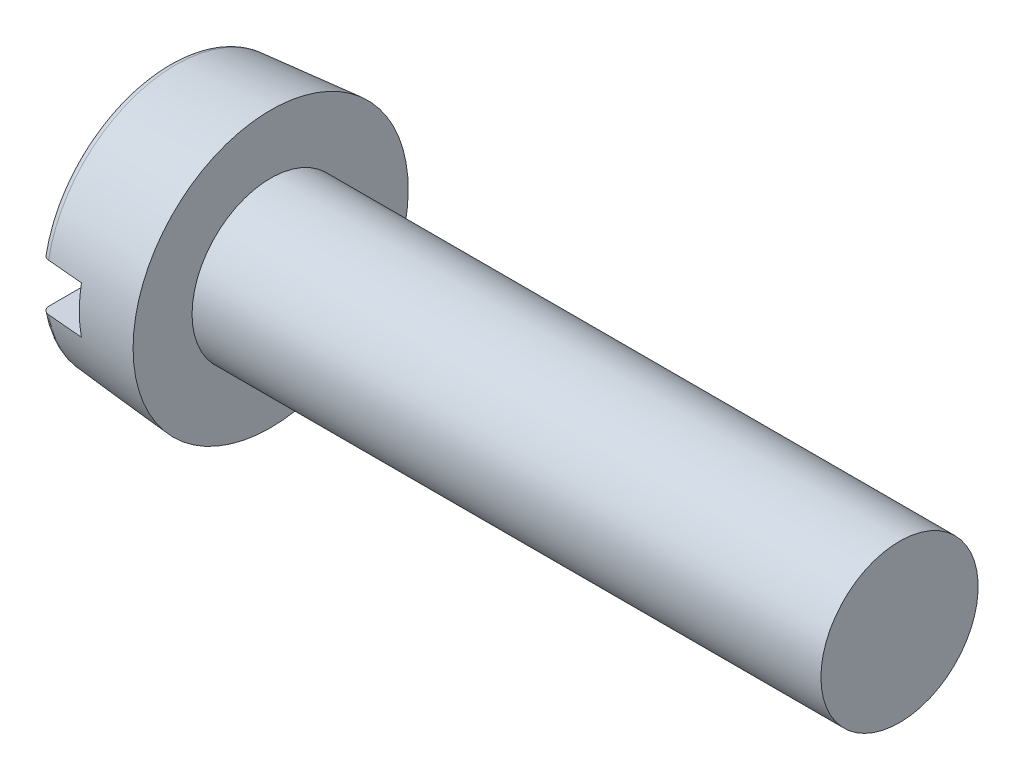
ISO-10303-21;
HEADER;
FILE_DESCRIPTION(('STEP AP214'),'2;1');
FILE_NAME('part.step','',(''),(''),'','','');
FILE_SCHEMA(('AUTOMOTIVE_DESIGN { 1 0 10303 214 1 1 1 1 }'));
ENDSEC;
DATA;
#1=APPLICATION_CONTEXT('core data for automotive mechanical design processes');
#2=APPLICATION_PROTOCOL_DEFINITION('international standard','automotive_design',2000,#1);
#3=PRODUCT_CONTEXT('',#1,'mechanical');
#4=PRODUCT('Part','Part','',(#3));
#5=PRODUCT_RELATED_PRODUCT_CATEGORY('part','',(#4));
#6=PRODUCT_DEFINITION_FORMATION('','',#4);
#7=PRODUCT_DEFINITION_CONTEXT('part definition',#1,'design');
#8=PRODUCT_DEFINITION('design','',#6,#7);
#9=PRODUCT_DEFINITION_SHAPE('','',#8);
#10=(LENGTH_UNIT() NAMED_UNIT(*) SI_UNIT(.MILLI.,.METRE.));
#11=(NAMED_UNIT(*) PLANE_ANGLE_UNIT() SI_UNIT($,.RADIAN.));
#12=(NAMED_UNIT(*) SI_UNIT($,.STERADIAN.) SOLID_ANGLE_UNIT());
#13=UNCERTAINTY_MEASURE_WITH_UNIT(LENGTH_MEASURE(1.E-05),#10,'distance_accuracy_value','');
#14=(GEOMETRIC_REPRESENTATION_CONTEXT(3) GLOBAL_UNCERTAINTY_ASSIGNED_CONTEXT((#13)) GLOBAL_UNIT_ASSIGNED_CONTEXT((#10,
#11,#12)) REPRESENTATION_CONTEXT('',''));
#15=CARTESIAN_POINT('',(0.,0.,0.));
#16=DIRECTION('',(0.,0.,1.));
#17=DIRECTION('',(1.,0.,0.));
#18=AXIS2_PLACEMENT_3D('',#15,#16,#17);
#19=CARTESIAN_POINT('',(0.,0.,0.));
#20=DIRECTION('',(-1.,0.,0.));
#21=DIRECTION('',(0.,0.,1.));
#22=AXIS2_PLACEMENT_3D('',#19,#20,#21);
#23=PLANE('',#22);
#24=DIRECTION('',(0.,0.,-1.));
#25=VECTOR('',#24,1.);
#26=CARTESIAN_POINT('',(0.,0.599999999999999,3.5));
#27=LINE('',#26,#25);
#28=CARTESIAN_POINT('',(0.,0.599999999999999,3.03043682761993));
#29=VERTEX_POINT('',#28);
#30=CARTESIAN_POINT('',(0.,0.599999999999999,-3.03043682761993));
#31=VERTEX_POINT('',#30);
#32=EDGE_CURVE('E103',#29,#31,#27,.T.);
#33=ORIENTED_EDGE('',*,*,#32,.F.);
#34=CARTESIAN_POINT('',(0.,0.,0.));
#35=DIRECTION('',(-1.,0.,0.));
#36=DIRECTION('',(0.,0.,1.));
#37=AXIS2_PLACEMENT_3D('',#34,#35,#36);
#38=CIRCLE('',#37,3.08926324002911);
#39=EDGE_CURVE('E106',#29,#31,#38,.T.);
#40=ORIENTED_EDGE('',*,*,#39,.T.);
#41=EDGE_LOOP('',(#33,#40));
#42=FACE_BOUND('',#41,.T.);
#43=ADVANCED_FACE('F35',(#42),#23,.T.);
#44=CARTESIAN_POINT('',(0.2,0.,0.));
#45=DIRECTION('',(-1.,0.,0.));
#46=DIRECTION('',(0.,0.,1.));
#47=AXIS2_PLACEMENT_3D('',#44,#45,#46);
#48=TOROIDAL_SURFACE('',#47,3.08926324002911,0.2);
#49=CARTESIAN_POINT('',(0.10595373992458,0.599999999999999,-3.21018161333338));
#50=CARTESIAN_POINT('',(0.115699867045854,0.599999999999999,-3.21546386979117));
#51=CARTESIAN_POINT('',(0.125895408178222,0.599999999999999,-3.21993251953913));
#52=CARTESIAN_POINT('',(0.146899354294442,0.599999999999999,-3.22710008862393));
#53=CARTESIAN_POINT('',(0.157708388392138,0.599999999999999,-3.22979715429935));
#54=CARTESIAN_POINT('',(0.179625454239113,0.599999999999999,-3.2333327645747));
#55=CARTESIAN_POINT('',(0.190733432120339,0.599999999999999,-3.23417164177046));
#56=CARTESIAN_POINT('',(0.212929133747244,0.599999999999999,-3.233964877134));
#57=CARTESIAN_POINT('',(0.224016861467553,0.599999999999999,-3.2329196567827));
#58=CARTESIAN_POINT('',(0.24582159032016,0.599999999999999,-3.22898503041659));
#59=CARTESIAN_POINT('',(0.256539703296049,0.599999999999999,-3.22610177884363));
#60=CARTESIAN_POINT('',(0.277343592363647,0.599999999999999,-3.21858540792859));
#61=CARTESIAN_POINT('',(0.287429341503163,0.599999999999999,-3.21395221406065));
#62=CARTESIAN_POINT('',(0.306739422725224,0.599999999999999,-3.20304847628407));
#63=CARTESIAN_POINT('',(0.315959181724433,0.599999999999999,-3.19676983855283));
#64=CARTESIAN_POINT('',(0.333231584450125,0.599999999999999,-3.18277301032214));
#65=CARTESIAN_POINT('',(0.341284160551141,0.599999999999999,-3.17505473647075));
#66=CARTESIAN_POINT('',(0.356112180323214,0.599999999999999,-3.15828860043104));
#67=CARTESIAN_POINT('',(0.362868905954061,0.599999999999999,-3.14922418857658));
#68=CARTESIAN_POINT('',(0.374794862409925,0.599999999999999,-3.13010544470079));
#69=CARTESIAN_POINT('',(0.379963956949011,0.599999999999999,-3.12005102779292));
#70=CARTESIAN_POINT('',(0.388661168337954,0.599999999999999,-3.09905295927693));
#71=CARTESIAN_POINT('',(0.392159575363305,0.599999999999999,-3.0880970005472));
#72=CARTESIAN_POINT('',(0.397296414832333,0.599999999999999,-3.06575733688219));
#73=CARTESIAN_POINT('',(0.398934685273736,0.599999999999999,-3.05437359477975));
#74=CARTESIAN_POINT('',(0.400323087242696,0.599999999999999,-3.03132781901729));
#75=CARTESIAN_POINT('',(0.40004590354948,0.599999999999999,-3.01966413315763));
#76=CARTESIAN_POINT('',(0.39754809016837,0.599999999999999,-2.9965463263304));
#77=CARTESIAN_POINT('',(0.39532736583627,0.599999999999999,-2.98509221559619));
#78=CARTESIAN_POINT('',(0.388983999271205,0.599999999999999,-2.96266069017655));
#79=CARTESIAN_POINT('',(0.384851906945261,0.599999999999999,-2.95168594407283));
#80=CARTESIAN_POINT('',(0.374790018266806,0.599999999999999,-2.93059330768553));
#81=CARTESIAN_POINT('',(0.368860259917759,0.599999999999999,-2.92047539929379));
#82=CARTESIAN_POINT('',(0.355413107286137,0.599999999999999,-2.90147355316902));
#83=CARTESIAN_POINT('',(0.347908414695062,0.599999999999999,-2.8925806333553));
#84=CARTESIAN_POINT('',(0.331487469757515,0.599999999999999,-2.87620998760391));
#85=CARTESIAN_POINT('',(0.322571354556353,0.599999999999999,-2.86873212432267));
#86=CARTESIAN_POINT('',(0.303753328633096,0.599999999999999,-2.85555292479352));
#87=CARTESIAN_POINT('',(0.293872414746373,0.599999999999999,-2.8498216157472));
#88=CARTESIAN_POINT('',(0.273273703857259,0.599999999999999,-2.84013920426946));
#89=CARTESIAN_POINT('',(0.262556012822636,0.599999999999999,-2.83618787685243));
#90=CARTESIAN_POINT('',(0.240822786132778,0.599999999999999,-2.83025814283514));
#91=CARTESIAN_POINT('',(0.229817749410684,0.599999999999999,-2.82824122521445));
#92=CARTESIAN_POINT('',(0.207625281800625,0.599999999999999,-2.82610837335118));
#93=CARTESIAN_POINT('',(0.196437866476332,0.599999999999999,-2.82599227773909));
#94=CARTESIAN_POINT('',(0.17433927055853,0.599999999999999,-2.82765455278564));
#95=CARTESIAN_POINT('',(0.163426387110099,0.599999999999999,-2.82941041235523));
#96=CARTESIAN_POINT('',(0.1420492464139,0.599999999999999,-2.83472469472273));
#97=CARTESIAN_POINT('',(0.131584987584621,0.599999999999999,-2.83828311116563));
#98=CARTESIAN_POINT('',(0.111366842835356,0.599999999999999,-2.8471025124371));
#99=CARTESIAN_POINT('',(0.101614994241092,0.599999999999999,-2.85236816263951));
#100=CARTESIAN_POINT('',(0.0831155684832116,0.599999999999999,-2.86443782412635));
#101=CARTESIAN_POINT('',(0.0743680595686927,0.599999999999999,-2.87124193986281));
#102=CARTESIAN_POINT('',(0.0579761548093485,0.599999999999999,-2.88630586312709));
#103=CARTESIAN_POINT('',(0.0503511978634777,0.599999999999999,-2.89458681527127));
#104=CARTESIAN_POINT('',(0.0365658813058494,0.599999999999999,-2.91228895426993));
#105=CARTESIAN_POINT('',(0.0304056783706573,0.599999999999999,-2.92171026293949));
#106=CARTESIAN_POINT('',(0.0195922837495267,0.599999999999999,-2.94163340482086));
#107=CARTESIAN_POINT('',(0.0149726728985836,0.599999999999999,-2.95215346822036));
#108=CARTESIAN_POINT('',(0.00753379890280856,0.599999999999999,-2.97381205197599));
#109=CARTESIAN_POINT('',(0.00471470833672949,0.599999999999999,-2.98495063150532));
#110=CARTESIAN_POINT('',(0.000917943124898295,0.599999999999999,-3.0077187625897));
#111=CARTESIAN_POINT('',(-2.99512472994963E-05,0.599999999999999,-3.01935328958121));
#112=CARTESIAN_POINT('',(3.13982112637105E-05,0.599999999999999,-3.04261715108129));
#113=CARTESIAN_POINT('',(0.00104065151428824,0.599999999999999,-3.05424648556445));
#114=CARTESIAN_POINT('',(0.00500199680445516,0.599999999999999,-3.077221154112));
#115=CARTESIAN_POINT('',(0.00796235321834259,0.599999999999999,-3.08856506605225));
#116=CARTESIAN_POINT('',(0.0157616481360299,0.599999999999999,-3.11059162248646));
#117=CARTESIAN_POINT('',(0.0206009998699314,0.599999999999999,-3.12127412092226));
#118=CARTESIAN_POINT('',(0.0319873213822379,0.599999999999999,-3.14158024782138));
#119=CARTESIAN_POINT('',(0.0385211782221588,0.599999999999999,-3.15121123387));
#120=CARTESIAN_POINT('',(0.0531333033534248,0.599999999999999,-3.16920723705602));
#121=CARTESIAN_POINT('',(0.0612095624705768,0.599999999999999,-3.17757387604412));
#122=CARTESIAN_POINT('',(0.0754611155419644,0.599999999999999,-3.18998949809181));
#123=CARTESIAN_POINT('',(0.0812448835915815,0.599999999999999,-3.1944955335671));
#124=CARTESIAN_POINT('',(0.0932716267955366,0.599999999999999,-3.20284662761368));
#125=CARTESIAN_POINT('',(0.0995145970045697,0.599999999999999,-3.2066916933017));
#126=CARTESIAN_POINT('',(0.10595373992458,0.599999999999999,-3.21018161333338));
#127=B_SPLINE_CURVE_WITH_KNOTS('',3,(#49,#50,#51,#52,#53,#54,#55,#56,#57,#58,#59,#60,#61,#62,
#63,#64,#65,#66,#67,#68,#69,#70,#71,#72,#73,#74,#75,#76,#77,#78,#79,#80,#81,#82,#83,#84,#85,#86,
#87,#88,#89,#90,#91,#92,#93,#94,#95,#96,#97,#98,#99,#100,#101,#102,#103,#104,#105,#106,#107,
#108,#109,#110,#111,#112,#113,#114,#115,#116,#117,#118,#119,#120,#121,#122,#123,#124,#125,#126),
.UNSPECIFIED.,.T.,.F.,(4,2,2,2,2,2,2,2,2,2,2,2,2,2,2,2,2,2,2,2,2,2,2,2,2,2,2,2,2,2,2,2,2,2,2,2,
2,2,4),(0.,0.0332301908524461,0.0664950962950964,0.099754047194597,0.133005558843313,
0.16614631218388,0.199288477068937,0.232596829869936,0.265907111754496,0.29966728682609,
0.333430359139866,0.367773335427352,0.402119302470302,0.436956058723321,0.471794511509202,
0.506807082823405,0.541818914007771,0.576558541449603,0.611294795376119,0.645396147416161,
0.679493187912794,0.712896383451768,0.746296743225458,0.779299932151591,0.812303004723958,
0.845397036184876,0.87849331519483,0.912108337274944,0.945726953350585,0.980036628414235,
1.01434959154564,1.04920438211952,1.08405934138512,1.11906289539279,1.15407415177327,
1.18882216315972,1.22352521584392,1.245480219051,1.26743498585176),.UNSPECIFIED.);
#128=CARTESIAN_POINT('',(0.182568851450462,0.599999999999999,-3.23330273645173));
#129=VERTEX_POINT('',#128);
#130=EDGE_CURVE('E58',#31,#129,#127,.T.);
#131=ORIENTED_EDGE('',*,*,#130,.F.);
#132=ORIENTED_EDGE('',*,*,#39,.F.);
#133=CARTESIAN_POINT('',(0.105016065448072,0.599999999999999,2.85080142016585));
#134=CARTESIAN_POINT('',(0.114691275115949,0.599999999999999,2.84546620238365));
#135=CARTESIAN_POINT('',(0.12481865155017,0.599999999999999,2.84093609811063));
#136=CARTESIAN_POINT('',(0.145696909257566,0.599999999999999,2.83363379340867));
#137=CARTESIAN_POINT('',(0.156448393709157,0.599999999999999,2.83086332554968));
#138=CARTESIAN_POINT('',(0.178265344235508,0.599999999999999,2.82717406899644));
#139=CARTESIAN_POINT('',(0.189330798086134,0.599999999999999,2.82625520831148));
#140=CARTESIAN_POINT('',(0.211455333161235,0.599999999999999,2.82629971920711));
#141=CARTESIAN_POINT('',(0.222514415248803,0.599999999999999,2.82726268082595));
#142=CARTESIAN_POINT('',(0.24425666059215,0.599999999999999,2.83102874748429));
#143=CARTESIAN_POINT('',(0.254941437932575,0.599999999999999,2.833822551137));
#144=CARTESIAN_POINT('',(0.27569543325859,0.599999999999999,2.84115235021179));
#145=CARTESIAN_POINT('',(0.285764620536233,0.599999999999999,2.84568843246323));
#146=CARTESIAN_POINT('',(0.305080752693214,0.599999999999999,2.85639977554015));
#147=CARTESIAN_POINT('',(0.314321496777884,0.599999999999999,2.86258620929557));
#148=CARTESIAN_POINT('',(0.331656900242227,0.599999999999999,2.87639692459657));
#149=CARTESIAN_POINT('',(0.339751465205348,0.599999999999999,2.88402132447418));
#150=CARTESIAN_POINT('',(0.354722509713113,0.599999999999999,2.90063675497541));
#151=CARTESIAN_POINT('',(0.361574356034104,0.599999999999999,2.90964997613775));
#152=CARTESIAN_POINT('',(0.373703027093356,0.599999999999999,2.92868002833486));
#153=CARTESIAN_POINT('',(0.378979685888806,0.599999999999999,2.93869696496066));
#154=CARTESIAN_POINT('',(0.387916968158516,0.599999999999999,2.95966673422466));
#155=CARTESIAN_POINT('',(0.391542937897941,0.599999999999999,2.97063434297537));
#156=CARTESIAN_POINT('',(0.396928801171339,0.599999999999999,2.99301875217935));
#157=CARTESIAN_POINT('',(0.398688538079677,0.599999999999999,3.00443559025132));
#158=CARTESIAN_POINT('',(0.40030679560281,0.599999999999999,3.02755271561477));
#159=CARTESIAN_POINT('',(0.400140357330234,0.599999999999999,3.03925475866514));
#160=CARTESIAN_POINT('',(0.397847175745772,0.599999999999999,3.06246562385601));
#161=CARTESIAN_POINT('',(0.395720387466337,0.599999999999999,3.07397444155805));
#162=CARTESIAN_POINT('',(0.389555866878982,0.599999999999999,3.09647750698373));
#163=CARTESIAN_POINT('',(0.385516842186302,0.599999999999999,3.1074714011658));
#164=CARTESIAN_POINT('',(0.375630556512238,0.599999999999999,3.12861423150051));
#165=CARTESIAN_POINT('',(0.369783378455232,0.599999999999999,3.13876320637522));
#166=CARTESIAN_POINT('',(0.356510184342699,0.599999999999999,3.15780612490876));
#167=CARTESIAN_POINT('',(0.349102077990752,0.599999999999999,3.1667125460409));
#168=CARTESIAN_POINT('',(0.332872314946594,0.599999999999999,3.18312834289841));
#169=CARTESIAN_POINT('',(0.324050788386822,0.599999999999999,3.19063784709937));
#170=CARTESIAN_POINT('',(0.305405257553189,0.599999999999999,3.20390997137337));
#171=CARTESIAN_POINT('',(0.295600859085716,0.599999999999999,3.20970013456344));
#172=CARTESIAN_POINT('',(0.275147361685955,0.599999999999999,3.21952148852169));
#173=CARTESIAN_POINT('',(0.264498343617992,0.599999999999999,3.22355284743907));
#174=CARTESIAN_POINT('',(0.242839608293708,0.599999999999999,3.22967901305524));
#175=CARTESIAN_POINT('',(0.231838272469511,0.599999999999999,3.23180347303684));
#176=CARTESIAN_POINT('',(0.209634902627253,0.599999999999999,3.2341574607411));
#177=CARTESIAN_POINT('',(0.198432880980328,0.599999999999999,3.23438710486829));
#178=CARTESIAN_POINT('',(0.176248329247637,0.599999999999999,3.23295068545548));
#179=CARTESIAN_POINT('',(0.165264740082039,0.599999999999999,3.23130090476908));
#180=CARTESIAN_POINT('',(0.143729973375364,0.599999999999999,3.22618337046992));
#181=CARTESIAN_POINT('',(0.133178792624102,0.599999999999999,3.22271563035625));
#182=CARTESIAN_POINT('',(0.112787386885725,0.599999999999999,3.21406153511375));
#183=CARTESIAN_POINT('',(0.102948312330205,0.599999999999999,3.20887247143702));
#184=CARTESIAN_POINT('',(0.0842683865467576,0.599999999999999,3.19693335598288));
#185=CARTESIAN_POINT('',(0.0754275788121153,0.599999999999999,3.19018323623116));
#186=CARTESIAN_POINT('',(0.0588875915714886,0.599999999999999,3.17523730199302));
#187=CARTESIAN_POINT('',(0.0512021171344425,0.599999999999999,3.16702632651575));
#188=CARTESIAN_POINT('',(0.0372916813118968,0.599999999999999,3.14944895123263));
#189=CARTESIAN_POINT('',(0.0310668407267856,0.599999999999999,3.14008245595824));
#190=CARTESIAN_POINT('',(0.0201439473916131,0.599999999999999,3.1202940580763));
#191=CARTESIAN_POINT('',(0.0154729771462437,0.599999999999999,3.10985720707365));
#192=CARTESIAN_POINT('',(0.00791811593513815,0.599999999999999,3.08835564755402));
#193=CARTESIAN_POINT('',(0.00503438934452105,0.599999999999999,3.07729088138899));
#194=CARTESIAN_POINT('',(0.00109145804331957,0.599999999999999,3.05465747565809));
#195=CARTESIAN_POINT('',(6.22854021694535E-05,0.599999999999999,3.04308359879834));
#196=CARTESIAN_POINT('',(-5.67976142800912E-05,0.599999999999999,3.01992599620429));
#197=CARTESIAN_POINT('',(0.000853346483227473,0.599999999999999,3.00834227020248));
#198=CARTESIAN_POINT('',(0.00460421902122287,0.599999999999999,2.98538851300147));
#199=CARTESIAN_POINT('',(0.00746152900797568,0.599999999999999,2.97402118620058));
#200=CARTESIAN_POINT('',(0.0150510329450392,0.599999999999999,2.95192660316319));
#201=CARTESIAN_POINT('',(0.0197836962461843,0.599999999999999,2.94119950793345));
#202=CARTESIAN_POINT('',(0.0309827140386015,0.599999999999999,2.92073316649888));
#203=CARTESIAN_POINT('',(0.0374439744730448,0.599999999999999,2.91099113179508));
#204=CARTESIAN_POINT('',(0.0519300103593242,0.599999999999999,2.89276112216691));
#205=CARTESIAN_POINT('',(0.0599527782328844,0.599999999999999,2.88427156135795));
#206=CARTESIAN_POINT('',(0.074201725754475,0.599999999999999,2.87159228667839));
#207=CARTESIAN_POINT('',(0.0800356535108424,0.599999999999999,2.86695454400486));
#208=CARTESIAN_POINT('',(0.0921833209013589,0.599999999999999,2.85835650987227));
#209=CARTESIAN_POINT('',(0.0984970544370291,0.599999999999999,2.85439620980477));
#210=CARTESIAN_POINT('',(0.105016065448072,0.599999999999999,2.85080142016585));
#211=B_SPLINE_CURVE_WITH_KNOTS('',3,(#133,#134,#135,#136,#137,#138,#139,#140,#141,#142,#143,
#144,#145,#146,#147,#148,#149,#150,#151,#152,#153,#154,#155,#156,#157,#158,#159,#160,#161,#162,
#163,#164,#165,#166,#167,#168,#169,#170,#171,#172,#173,#174,#175,#176,#177,#178,#179,#180,#181,
#182,#183,#184,#185,#186,#187,#188,#189,#190,#191,#192,#193,#194,#195,#196,#197,#198,#199,#200,
#201,#202,#203,#204,#205,#206,#207,#208,#209,#210),.UNSPECIFIED.,.T.,.F.,(4,2,2,2,2,2,2,2,2,2,2,
2,2,2,2,2,2,2,2,2,2,2,2,2,2,2,2,2,2,2,2,2,2,2,2,2,2,2,4),(0.,0.0331194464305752,
0.0662714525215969,0.0994221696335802,0.132565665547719,0.165542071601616,0.198520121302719,
0.23172736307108,0.264937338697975,0.298746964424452,0.332560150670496,0.367053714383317,
0.401550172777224,0.436494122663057,0.471438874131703,0.506407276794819,0.541374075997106,
0.575959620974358,0.610541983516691,0.644536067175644,0.678526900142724,0.711979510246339,
0.745430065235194,0.778593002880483,0.811755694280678,0.844970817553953,0.878187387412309,
0.91177126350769,0.945357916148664,0.979502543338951,1.01365031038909,1.04834624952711,
1.08304316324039,1.11803930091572,1.15304420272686,1.18794706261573,1.22280534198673,
1.24512101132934,1.26743639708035),.UNSPECIFIED.);
#212=CARTESIAN_POINT('',(0.182568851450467,0.599999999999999,3.23330273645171));
#213=VERTEX_POINT('',#212);
#214=EDGE_CURVE('E95',#213,#29,#211,.T.);
#215=ORIENTED_EDGE('',*,*,#214,.F.);
#216=CARTESIAN_POINT('',(0.182568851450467,0.,0.));
#217=DIRECTION('',(-1.,0.,0.));
#218=DIRECTION('',(0.,0.,1.));
#219=AXIS2_PLACEMENT_3D('',#216,#217,#218);
#220=CIRCLE('',#219,3.28850217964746);
#221=EDGE_CURVE('E110',#129,#213,#220,.F.);
#222=ORIENTED_EDGE('',*,*,#221,.F.);
#223=EDGE_LOOP('',(#131,#132,#215,#222));
#224=FACE_BOUND('',#223,.T.);
#225=ADVANCED_FACE('F181',(#224),#48,.T.);
#226=CARTESIAN_POINT('',(-25.4,0.,0.));
#227=DIRECTION('',(-1.,0.,0.));
#228=DIRECTION('',(0.,0.,1.));
#229=AXIS2_PLACEMENT_3D('',#226,#227,#228);
#230=CYLINDRICAL_SURFACE('',#229,2.);
#231=CARTESIAN_POINT('',(18.6,0.,0.));
#232=DIRECTION('',(-1.,0.,0.));
#233=DIRECTION('',(0.,0.,1.));
#234=AXIS2_PLACEMENT_3D('',#231,#232,#233);
#235=CIRCLE('',#234,2.);
#236=CARTESIAN_POINT('',(18.6,0.,2.));
#237=VERTEX_POINT('',#236);
#238=EDGE_CURVE('E170',#237,#237,#235,.T.);
#239=ORIENTED_EDGE('',*,*,#238,.T.);
#240=EDGE_LOOP('',(#239));
#241=FACE_BOUND('',#240,.T.);
#242=CARTESIAN_POINT('',(2.6,0.,0.));
#243=DIRECTION('',(-1.,0.,0.));
#244=DIRECTION('',(0.,0.,1.));
#245=AXIS2_PLACEMENT_3D('',#242,#243,#244);
#246=CIRCLE('',#245,2.);
#247=CARTESIAN_POINT('',(2.6,0.,2.));
#248=VERTEX_POINT('',#247);
#249=EDGE_CURVE('E107',#248,#248,#246,.T.);
#250=ORIENTED_EDGE('',*,*,#249,.F.);
#251=EDGE_LOOP('',(#250));
#252=FACE_BOUND('',#251,.T.);
#253=ADVANCED_FACE('F37',(#241,#252),#230,.T.);
#254=CARTESIAN_POINT('',(2.6,2.,0.));
#255=DIRECTION('',(-1.,0.,0.));
#256=DIRECTION('',(0.,0.,1.));
#257=AXIS2_PLACEMENT_3D('',#254,#255,#256);
#258=PLANE('',#257);
#259=CARTESIAN_POINT('',(2.6,0.,0.));
#260=DIRECTION('',(-1.,0.,0.));
#261=DIRECTION('',(0.,0.,1.));
#262=AXIS2_PLACEMENT_3D('',#259,#260,#261);
#263=CIRCLE('',#262,3.5);
#264=CARTESIAN_POINT('',(2.6,0.,3.5));
#265=VERTEX_POINT('',#264);
#266=EDGE_CURVE('E112',#265,#265,#263,.T.);
#267=ORIENTED_EDGE('',*,*,#266,.F.);
#268=EDGE_LOOP('',(#267));
#269=FACE_BOUND('',#268,.T.);
#270=ORIENTED_EDGE('',*,*,#249,.T.);
#271=EDGE_LOOP('',(#270));
#272=FACE_BOUND('',#271,.T.);
#273=ADVANCED_FACE('F155',(#269,#272),#258,.F.);
#274=CARTESIAN_POINT('',(0.,0.,0.));
#275=DIRECTION('',(1.,0.,0.));
#276=DIRECTION('',(0.,0.,-1.));
#277=AXIS2_PLACEMENT_3D('',#274,#275,#276);
#278=CONICAL_SURFACE('',#277,3.2725294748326,0.0872664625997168);
#279=CARTESIAN_POINT('',(-5.50655611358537,0.599999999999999,-2.72550680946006));
#280=CARTESIAN_POINT('',(-3.80202221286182,0.599999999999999,-2.87818079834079));
#281=CARTESIAN_POINT('',(-2.0974409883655,0.599999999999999,-3.03032472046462));
#282=CARTESIAN_POINT('',(-0.067381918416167,0.599999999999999,-3.2110638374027));
#283=CARTESIAN_POINT('',(0.258063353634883,0.599999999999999,-3.24002475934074));
#284=CARTESIAN_POINT('',(2.61358356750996,0.599999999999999,-3.44954593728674));
#285=CARTESIAN_POINT('',(4.64370165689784,0.599999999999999,-3.62962140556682));
#286=CARTESIAN_POINT('',(6.67384119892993,0.599999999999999,-3.80945351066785));
#287=B_SPLINE_CURVE_WITH_KNOTS('',3,(#279,#280,#281,#282,#283,#284,#285,#286),.UNSPECIFIED.,.F.,
.F.,(4,2,2,4),(0.,5.13407279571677,6.11426677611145,12.2285333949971),.UNSPECIFIED.);
#288=CARTESIAN_POINT('',(1.1,0.599999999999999,-3.31490439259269));
#289=VERTEX_POINT('',#288);
#290=EDGE_CURVE('E165',#129,#289,#287,.T.);
#291=ORIENTED_EDGE('',*,*,#290,.F.);
#292=ORIENTED_EDGE('',*,*,#221,.T.);
#293=CARTESIAN_POINT('',(6.67384119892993,0.599999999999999,3.80945351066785));
#294=CARTESIAN_POINT('',(5.65877031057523,0.599999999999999,3.7195495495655));
#295=CARTESIAN_POINT('',(4.64370583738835,0.599999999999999,3.62957307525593));
#296=CARTESIAN_POINT('',(2.6135939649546,0.599999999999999,3.44942842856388));
#297=CARTESIAN_POINT('',(1.59854656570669,0.599999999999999,3.359260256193));
#298=CARTESIAN_POINT('',(-0.431527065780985,0.599999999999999,3.17868552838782));
#299=CARTESIAN_POINT('',(-1.44655329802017,0.599999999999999,3.088278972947));
#300=CARTESIAN_POINT('',(-3.47657760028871,0.599999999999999,2.90714957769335));
#301=CARTESIAN_POINT('',(-4.49157567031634,0.599999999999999,2.81642673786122));
#302=CARTESIAN_POINT('',(-5.50655611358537,0.599999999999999,2.72550680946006));
#303=B_SPLINE_CURVE_WITH_KNOTS('',3,(#293,#294,#295,#296,#297,#298,#299,#300,#301,#302),
.UNSPECIFIED.,.F.,.F.,(4,2,2,2,4),(0.,3.05713341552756,6.11426664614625,9.17139996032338,
12.2285334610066),.UNSPECIFIED.);
#304=CARTESIAN_POINT('',(1.1,0.599999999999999,3.31490439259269));
#305=VERTEX_POINT('',#304);
#306=EDGE_CURVE('E161',#305,#213,#303,.T.);
#307=ORIENTED_EDGE('',*,*,#306,.F.);
#308=CARTESIAN_POINT('',(1.1,0.,0.));
#309=DIRECTION('',(-1.,0.,0.));
#310=DIRECTION('',(0.,0.,1.));
#311=AXIS2_PLACEMENT_3D('',#308,#309,#310);
#312=CIRCLE('',#311,3.36876700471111);
#313=CARTESIAN_POINT('',(1.1,-0.6,3.31490439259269));
#314=VERTEX_POINT('',#313);
#315=EDGE_CURVE('E39',#305,#314,#312,.F.);
#316=ORIENTED_EDGE('',*,*,#315,.T.);
#317=CARTESIAN_POINT('',(-5.50655611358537,-0.6,2.72550680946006));
#318=CARTESIAN_POINT('',(-3.80202221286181,-0.6,2.87818079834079));
#319=CARTESIAN_POINT('',(-2.0974409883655,-0.6,3.03032472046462));
#320=CARTESIAN_POINT('',(-0.0673819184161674,-0.6,3.2110638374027));
#321=CARTESIAN_POINT('',(0.258063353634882,-0.6,3.24002475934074));
#322=CARTESIAN_POINT('',(2.61358356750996,-0.6,3.44954593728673));
#323=CARTESIAN_POINT('',(4.64370165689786,-0.6,3.62962140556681));
#324=CARTESIAN_POINT('',(6.67384119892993,-0.6,3.80945351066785));
#325=B_SPLINE_CURVE_WITH_KNOTS('',3,(#317,#318,#319,#320,#321,#322,#323,#324),.UNSPECIFIED.,.F.,
.F.,(4,2,2,4),(0.,5.13407279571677,6.11426677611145,12.2285333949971),.UNSPECIFIED.);
#326=CARTESIAN_POINT('',(0.182568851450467,-0.6,3.23330273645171));
#327=VERTEX_POINT('',#326);
#328=EDGE_CURVE('E139',#327,#314,#325,.T.);
#329=ORIENTED_EDGE('',*,*,#328,.F.);
#330=CARTESIAN_POINT('',(0.182568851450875,-0.599999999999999,-3.23330273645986));
#331=VERTEX_POINT('',#330);
#332=EDGE_CURVE('E116',#327,#331,#220,.F.);
#333=ORIENTED_EDGE('',*,*,#332,.T.);
#334=CARTESIAN_POINT('',(6.67384119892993,-0.599999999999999,-3.80945351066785));
#335=CARTESIAN_POINT('',(5.65877031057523,-0.599999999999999,-3.7195495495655));
#336=CARTESIAN_POINT('',(4.64370583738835,-0.599999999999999,-3.62957307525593));
#337=CARTESIAN_POINT('',(2.6135939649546,-0.599999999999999,-3.44942842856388));
#338=CARTESIAN_POINT('',(1.59854656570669,-0.599999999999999,-3.359260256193));
#339=CARTESIAN_POINT('',(-0.431527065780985,-0.599999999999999,-3.17868552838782));
#340=CARTESIAN_POINT('',(-1.44655329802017,-0.6,-3.088278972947));
#341=CARTESIAN_POINT('',(-3.47657760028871,-0.6,-2.90714957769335));
#342=CARTESIAN_POINT('',(-4.49157567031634,-0.6,-2.81642673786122));
#343=CARTESIAN_POINT('',(-5.50655611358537,-0.6,-2.72550680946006));
#344=B_SPLINE_CURVE_WITH_KNOTS('',3,(#334,#335,#336,#337,#338,#339,#340,#341,#342,#343),
.UNSPECIFIED.,.F.,.F.,(4,2,2,2,4),(0.,3.05713341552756,6.11426664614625,9.17139996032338,
12.2285334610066),.UNSPECIFIED.);
#345=CARTESIAN_POINT('',(1.1,-0.599999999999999,-3.31490439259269));
#346=VERTEX_POINT('',#345);
#347=EDGE_CURVE('E90',#346,#331,#344,.T.);
#348=ORIENTED_EDGE('',*,*,#347,.F.);
#349=EDGE_CURVE('E11',#346,#289,#312,.F.);
#350=ORIENTED_EDGE('',*,*,#349,.T.);
#351=EDGE_LOOP('',(#291,#292,#307,#316,#329,#333,#348,#350));
#352=FACE_BOUND('',#351,.T.);
#353=ORIENTED_EDGE('',*,*,#266,.T.);
#354=EDGE_LOOP('',(#353));
#355=FACE_BOUND('',#354,.T.);
#356=ADVANCED_FACE('F151',(#352,#355),#278,.T.);
#357=DIRECTION('',(0.,0.,1.));
#358=VECTOR('',#357,1.);
#359=CARTESIAN_POINT('',(0.,-0.599999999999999,-3.5));
#360=LINE('',#359,#358);
#361=CARTESIAN_POINT('',(0.,-0.599999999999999,-3.03043682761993));
#362=VERTEX_POINT('',#361);
#363=CARTESIAN_POINT('',(0.,-0.6,3.03043682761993));
#364=VERTEX_POINT('',#363);
#365=EDGE_CURVE('E50',#362,#364,#360,.T.);
#366=ORIENTED_EDGE('',*,*,#365,.F.);
#367=EDGE_CURVE('E101',#362,#364,#38,.T.);
#368=ORIENTED_EDGE('',*,*,#367,.T.);
#369=EDGE_LOOP('',(#366,#368));
#370=FACE_BOUND('',#369,.T.);
#371=ADVANCED_FACE('F100',(#370),#23,.T.);
#372=CARTESIAN_POINT('',(18.6,2.,0.));
#373=DIRECTION('',(1.,0.,0.));
#374=DIRECTION('',(0.,0.,-1.));
#375=AXIS2_PLACEMENT_3D('',#372,#373,#374);
#376=PLANE('',#375);
#377=ORIENTED_EDGE('',*,*,#238,.F.);
#378=EDGE_LOOP('',(#377));
#379=FACE_BOUND('',#378,.T.);
#380=ADVANCED_FACE('F193',(#379),#376,.T.);
#381=CARTESIAN_POINT('',(0.10595373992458,-0.599999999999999,-3.21018161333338));
#382=CARTESIAN_POINT('',(0.0960146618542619,-0.599999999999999,-3.20479360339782));
#383=CARTESIAN_POINT('',(0.0865284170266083,-0.599999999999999,-3.19855129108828));
#384=CARTESIAN_POINT('',(0.0687367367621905,-0.599999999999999,-3.18455028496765));
#385=CARTESIAN_POINT('',(0.0604329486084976,-0.599999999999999,-3.17678951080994));
#386=CARTESIAN_POINT('',(0.0452497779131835,-0.599999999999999,-3.15999804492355));
#387=CARTESIAN_POINT('',(0.0383686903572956,-0.599999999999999,-3.15096889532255));
#388=CARTESIAN_POINT('',(0.0261997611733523,-0.599999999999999,-3.13189878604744));
#389=CARTESIAN_POINT('',(0.0209115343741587,-0.599999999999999,-3.12185807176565));
#390=CARTESIAN_POINT('',(0.0120001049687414,-0.599999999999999,-3.10091081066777));
#391=CARTESIAN_POINT('',(0.00839912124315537,-0.599999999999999,-3.08999481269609));
#392=CARTESIAN_POINT('',(0.00305136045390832,-0.599999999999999,-3.06771714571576));
#393=CARTESIAN_POINT('',(0.00130482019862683,-0.599999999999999,-3.0563554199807));
#394=CARTESIAN_POINT('',(-0.000304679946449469,-0.599999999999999,-3.03333344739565));
#395=CARTESIAN_POINT('',(-0.000139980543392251,-0.599999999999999,-3.02167126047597));
#396=CARTESIAN_POINT('',(0.00213350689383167,-0.599999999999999,-2.99853754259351));
#397=CARTESIAN_POINT('',(0.00424239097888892,-0.6,-2.9870660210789));
#398=CARTESIAN_POINT('',(0.0103660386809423,-0.6,-2.96457689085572));
#399=CARTESIAN_POINT('',(0.0143909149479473,-0.6,-2.95356203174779));
#400=CARTESIAN_POINT('',(0.0242460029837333,-0.6,-2.93237123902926));
#401=CARTESIAN_POINT('',(0.0300761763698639,-0.6,-2.92219528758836));
#402=CARTESIAN_POINT('',(0.0433378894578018,-0.6,-2.90305748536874));
#403=CARTESIAN_POINT('',(0.0507572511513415,-0.6,-2.89408720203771));
#404=CARTESIAN_POINT('',(0.0670217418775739,-0.6,-2.87754799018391));
#405=CARTESIAN_POINT('',(0.0758667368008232,-0.6,-2.86997892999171));
#406=CARTESIAN_POINT('',(0.0945622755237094,-0.6,-2.85660637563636));
#407=CARTESIAN_POINT('',(0.104391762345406,-0.6,-2.85077345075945));
#408=CARTESIAN_POINT('',(0.124905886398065,-0.6,-2.8408806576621));
#409=CARTESIAN_POINT('',(0.135590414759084,-0.6,-2.8368205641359));
#410=CARTESIAN_POINT('',(0.157276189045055,-0.6,-2.83067225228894));
#411=CARTESIAN_POINT('',(0.168266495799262,-0.6,-2.82854542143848));
#412=CARTESIAN_POINT('',(0.190448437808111,-0.6,-2.82619258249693));
#413=CARTESIAN_POINT('',(0.2016400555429,-0.6,-2.82596640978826));
#414=CARTESIAN_POINT('',(0.223761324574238,-0.6,-2.82741304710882));
#415=CARTESIAN_POINT('',(0.234692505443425,-0.6,-2.82906261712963));
#416=CARTESIAN_POINT('',(0.256123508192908,-0.6,-2.83416971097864));
#417=CARTESIAN_POINT('',(0.266623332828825,-0.6,-2.83762722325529));
#418=CARTESIAN_POINT('',(0.286924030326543,-0.6,-2.84625101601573));
#419=CARTESIAN_POINT('',(0.296723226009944,-0.6,-2.85142124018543));
#420=CARTESIAN_POINT('',(0.315332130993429,-0.6,-2.86330962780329));
#421=CARTESIAN_POINT('',(0.324141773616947,-0.6,-2.87002789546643));
#422=CARTESIAN_POINT('',(0.340669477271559,-0.6,-2.88492851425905));
#423=CARTESIAN_POINT('',(0.348368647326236,-0.6,-2.89313181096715));
#424=CARTESIAN_POINT('',(0.362314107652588,-0.6,-2.91069187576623));
#425=CARTESIAN_POINT('',(0.368560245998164,-0.6,-2.92004876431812));
#426=CARTESIAN_POINT('',(0.379556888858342,-0.6,-2.93985667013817));
#427=CARTESIAN_POINT('',(0.384274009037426,-0.6,-2.95032622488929));
#428=CARTESIAN_POINT('',(0.391915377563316,-0.6,-2.97190043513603));
#429=CARTESIAN_POINT('',(0.394839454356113,-0.6,-2.98300515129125));
#430=CARTESIAN_POINT('',(0.398853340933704,-0.6,-3.00572547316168));
#431=CARTESIAN_POINT('',(0.399913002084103,-0.599999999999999,-3.01734641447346));
#432=CARTESIAN_POINT('',(0.400076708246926,-0.599999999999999,-3.040602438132));
#433=CARTESIAN_POINT('',(0.399180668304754,-0.599999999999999,-3.05223752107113));
#434=CARTESIAN_POINT('',(0.395443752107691,-0.599999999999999,-3.07524842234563));
#435=CARTESIAN_POINT('',(0.392593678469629,-0.599999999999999,-3.08662275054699));
#436=CARTESIAN_POINT('',(0.385009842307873,-0.599999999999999,-3.10872565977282));
#437=CARTESIAN_POINT('',(0.380276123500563,-0.599999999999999,-3.11945425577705));
#438=CARTESIAN_POINT('',(0.369091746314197,-0.599999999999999,-3.13986909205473));
#439=CARTESIAN_POINT('',(0.362654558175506,-0.599999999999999,-3.1495627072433));
#440=CARTESIAN_POINT('',(0.348219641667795,-0.599999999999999,-3.16770913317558));
#441=CARTESIAN_POINT('',(0.340222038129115,-0.599999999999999,-3.17616204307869));
#442=CARTESIAN_POINT('',(0.323027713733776,-0.599999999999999,-3.19144232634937));
#443=CARTESIAN_POINT('',(0.313851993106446,-0.599999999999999,-3.19829332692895));
#444=CARTESIAN_POINT('',(0.294464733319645,-0.599999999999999,-3.21032583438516));
#445=CARTESIAN_POINT('',(0.284253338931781,-0.599999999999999,-3.2155075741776));
#446=CARTESIAN_POINT('',(0.263272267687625,-0.599999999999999,-3.22396402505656));
#447=CARTESIAN_POINT('',(0.252515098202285,-0.599999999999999,-3.22726978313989));
#448=CARTESIAN_POINT('',(0.230592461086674,-0.599999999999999,-3.23200581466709));
#449=CARTESIAN_POINT('',(0.219426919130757,-0.599999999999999,-3.23343574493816));
#450=CARTESIAN_POINT('',(0.197138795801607,-0.599999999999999,-3.23436881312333));
#451=CARTESIAN_POINT('',(0.186017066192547,-0.599999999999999,-3.23389272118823));
#452=CARTESIAN_POINT('',(0.164022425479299,-0.599999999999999,-3.23107504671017));
#453=CARTESIAN_POINT('',(0.153149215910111,-0.599999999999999,-3.22873583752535));
#454=CARTESIAN_POINT('',(0.136218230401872,-0.599999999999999,-3.2235728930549));
#455=CARTESIAN_POINT('',(0.129980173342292,-0.599999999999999,-3.22132097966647));
#456=CARTESIAN_POINT('',(0.117760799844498,-0.599999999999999,-3.21620441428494));
#457=CARTESIAN_POINT('',(0.11177948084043,-0.599999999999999,-3.21333976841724));
#458=CARTESIAN_POINT('',(0.10595373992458,-0.599999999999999,-3.21018161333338));
#459=B_SPLINE_CURVE_WITH_KNOTS('',3,(#381,#382,#383,#384,#385,#386,#387,#388,#389,#390,#391,
#392,#393,#394,#395,#396,#397,#398,#399,#400,#401,#402,#403,#404,#405,#406,#407,#408,#409,#410,
#411,#412,#413,#414,#415,#416,#417,#418,#419,#420,#421,#422,#423,#424,#425,#426,#427,#428,#429,
#430,#431,#432,#433,#434,#435,#436,#437,#438,#439,#440,#441,#442,#443,#444,#445,#446,#447,#448,
#449,#450,#451,#452,#453,#454,#455,#456,#457,#458),.UNSPECIFIED.,.T.,.F.,(4,2,2,2,2,2,2,2,2,2,2,
2,2,2,2,2,2,2,2,2,2,2,2,2,2,2,2,2,2,2,2,2,2,2,2,2,2,2,4),(0.,0.0338920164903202,
0.0678307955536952,0.10172866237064,0.135618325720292,0.169942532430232,0.204271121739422,
0.239097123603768,0.273924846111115,0.308938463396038,0.343951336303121,0.378704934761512,
0.413455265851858,0.447577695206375,0.481695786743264,0.51511643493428,0.548534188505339,
0.58154237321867,0.61455034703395,0.647634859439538,0.680721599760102,0.714317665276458,
0.74791724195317,0.782207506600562,0.816501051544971,0.851344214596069,0.886188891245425,
0.921198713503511,0.956207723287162,0.990947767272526,1.02568503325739,1.05987207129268,
1.09405433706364,1.12765303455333,1.16125787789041,1.19449752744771,1.22769490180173,
1.24756073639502,1.26742637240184),.UNSPECIFIED.);
#460=EDGE_CURVE('E86',#331,#362,#459,.T.);
#461=ORIENTED_EDGE('',*,*,#460,.F.);
#462=ORIENTED_EDGE('',*,*,#332,.F.);
#463=CARTESIAN_POINT('',(0.105016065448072,-0.6,2.85080142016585));
#464=CARTESIAN_POINT('',(0.0950844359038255,-0.6,2.85627921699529));
#465=CARTESIAN_POINT('',(0.0856147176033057,-0.6,2.86261371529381));
#466=CARTESIAN_POINT('',(0.0678721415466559,-0.6,2.87679618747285));
#467=CARTESIAN_POINT('',(0.059601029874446,-0.6,2.88464633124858));
#468=CARTESIAN_POINT('',(0.0444968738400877,-0.6,2.90160680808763));
#469=CARTESIAN_POINT('',(0.0376618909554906,-0.6,2.91071541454));
#470=CARTESIAN_POINT('',(0.02559371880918,-0.6,2.92993348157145));
#471=CARTESIAN_POINT('',(0.0203601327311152,-0.6,2.94004269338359));
#472=CARTESIAN_POINT('',(0.0115562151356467,-0.6,2.96113928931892));
#473=CARTESIAN_POINT('',(0.00801194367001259,-0.6,2.97213755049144));
#474=CARTESIAN_POINT('',(0.00279364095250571,-0.6,2.99456990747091));
#475=CARTESIAN_POINT('',(0.00111984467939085,-0.6,3.00600405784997));
#476=CARTESIAN_POINT('',(-0.00032284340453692,-0.6,3.0291390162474));
#477=CARTESIAN_POINT('',(-6.71585840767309E-05,-0.6,3.04084136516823));
#478=CARTESIAN_POINT('',(0.00240390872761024,-0.6,3.06403774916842));
#479=CARTESIAN_POINT('',(0.00461933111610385,-0.6,3.07553178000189));
#480=CARTESIAN_POINT('',(0.0109573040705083,-0.6,3.09798695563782));
#481=CARTESIAN_POINT('',(0.0150805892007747,-0.6,3.10894789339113));
#482=CARTESIAN_POINT('',(0.0251289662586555,-0.6,3.13001071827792));
#483=CARTESIAN_POINT('',(0.0310539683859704,-0.6,3.14011264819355));
#484=CARTESIAN_POINT('',(0.0444717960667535,-0.6,3.15904704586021));
#485=CARTESIAN_POINT('',(0.0519464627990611,-0.6,3.1678923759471));
#486=CARTESIAN_POINT('',(0.0682980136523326,-0.6,3.18417542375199));
#487=CARTESIAN_POINT('',(0.0771747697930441,-0.6,3.19161326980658));
#488=CARTESIAN_POINT('',(0.095916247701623,-0.6,3.20473451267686));
#489=CARTESIAN_POINT('',(0.105761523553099,-0.6,3.21044568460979));
#490=CARTESIAN_POINT('',(0.126282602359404,-0.6,3.22010343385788));
#491=CARTESIAN_POINT('',(0.136958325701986,-0.6,3.22405018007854));
#492=CARTESIAN_POINT('',(0.158656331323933,-0.6,3.23000588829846));
#493=CARTESIAN_POINT('',(0.169670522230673,-0.6,3.23204435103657));
#494=CARTESIAN_POINT('',(0.191884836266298,-0.6,3.2342258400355));
#495=CARTESIAN_POINT('',(0.203084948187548,-0.6,3.23436898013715));
#496=CARTESIAN_POINT('',(0.225253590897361,-0.6,3.23276234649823));
#497=CARTESIAN_POINT('',(0.23622327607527,-0.6,3.23102843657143));
#498=CARTESIAN_POINT('',(0.257716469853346,-0.6,3.22574661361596));
#499=CARTESIAN_POINT('',(0.268239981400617,-0.6,3.22219871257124));
#500=CARTESIAN_POINT('',(0.288565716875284,-0.6,3.21338945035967));
#501=CARTESIAN_POINT('',(0.298366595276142,-0.6,3.20812498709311));
#502=CARTESIAN_POINT('',(0.31695837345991,-0.6,3.19604273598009));
#503=CARTESIAN_POINT('',(0.325749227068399,-0.6,3.18922487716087));
#504=CARTESIAN_POINT('',(0.34218002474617,-0.6,3.17415085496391));
#505=CARTESIAN_POINT('',(0.349805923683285,-0.6,3.16587938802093));
#506=CARTESIAN_POINT('',(0.363588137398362,-0.6,3.14819177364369));
#507=CARTESIAN_POINT('',(0.369744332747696,-0.6,3.1387755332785));
#508=CARTESIAN_POINT('',(0.380521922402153,-0.6,3.11889822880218));
#509=CARTESIAN_POINT('',(0.385116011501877,-0.6,3.10842236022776));
#510=CARTESIAN_POINT('',(0.392511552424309,-0.6,3.08685595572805));
#511=CARTESIAN_POINT('',(0.395312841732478,-0.6,3.07576536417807));
#512=CARTESIAN_POINT('',(0.39908584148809,-0.6,3.05309509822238));
#513=CARTESIAN_POINT('',(0.400027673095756,-0.6,3.04151044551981));
#514=CARTESIAN_POINT('',(0.39997108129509,-0.6,3.01834558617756));
#515=CARTESIAN_POINT('',(0.398972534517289,-0.6,3.00676537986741));
#516=CARTESIAN_POINT('',(0.395045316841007,-0.6,2.98383505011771));
#517=CARTESIAN_POINT('',(0.392100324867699,-0.6,2.97248771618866));
#518=CARTESIAN_POINT('',(0.384340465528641,-0.6,2.9504508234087));
#519=CARTESIAN_POINT('',(0.379525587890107,-0.6,2.93976126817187));
#520=CARTESIAN_POINT('',(0.36817282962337,-0.6,2.91939094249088));
#521=CARTESIAN_POINT('',(0.361641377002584,-0.6,2.90970659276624));
#522=CARTESIAN_POINT('',(0.347021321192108,-0.6,2.89159401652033));
#523=CARTESIAN_POINT('',(0.338932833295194,-0.6,2.88316569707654));
#524=CARTESIAN_POINT('',(0.321559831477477,-0.6,2.86794978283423));
#525=CARTESIAN_POINT('',(0.312295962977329,-0.6,2.86113862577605));
#526=CARTESIAN_POINT('',(0.292736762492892,-0.6,2.84920768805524));
#527=CARTESIAN_POINT('',(0.282441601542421,-0.6,2.84408762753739));
#528=CARTESIAN_POINT('',(0.261343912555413,-0.6,2.83579582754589));
#529=CARTESIAN_POINT('',(0.250556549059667,-0.6,2.83258548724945));
#530=CARTESIAN_POINT('',(0.228589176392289,-0.6,2.82805287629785));
#531=CARTESIAN_POINT('',(0.217409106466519,-0.6,2.82673089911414));
#532=CARTESIAN_POINT('',(0.195158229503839,-0.6,2.82602507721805));
#533=CARTESIAN_POINT('',(0.184088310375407,-0.6,2.8266123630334));
#534=CARTESIAN_POINT('',(0.162215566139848,-0.6,2.829642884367));
#535=CARTESIAN_POINT('',(0.151412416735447,-0.6,2.83208373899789));
#536=CARTESIAN_POINT('',(0.13468093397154,-0.6,2.83737290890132));
#537=CARTESIAN_POINT('',(0.128564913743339,-0.6,2.83964690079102));
#538=CARTESIAN_POINT('',(0.116587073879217,-0.6,2.84478670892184));
#539=CARTESIAN_POINT('',(0.110725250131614,-0.6,2.84765251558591));
#540=CARTESIAN_POINT('',(0.105016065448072,-0.6,2.85080142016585));
#541=B_SPLINE_CURVE_WITH_KNOTS('',3,(#463,#464,#465,#466,#467,#468,#469,#470,#471,#472,#473,
#474,#475,#476,#477,#478,#479,#480,#481,#482,#483,#484,#485,#486,#487,#488,#489,#490,#491,#492,
#493,#494,#495,#496,#497,#498,#499,#500,#501,#502,#503,#504,#505,#506,#507,#508,#509,#510,#511,
#512,#513,#514,#515,#516,#517,#518,#519,#520,#521,#522,#523,#524,#525,#526,#527,#528,#529,#530,
#531,#532,#533,#534,#535,#536,#537,#538,#539,#540),.UNSPECIFIED.,.T.,.F.,(4,2,2,2,2,2,2,2,2,2,2,
2,2,2,2,2,2,2,2,2,2,2,2,2,2,2,2,2,2,2,2,2,2,2,2,2,2,2,4),(0.,0.0340019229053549,
0.0680528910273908,0.102057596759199,0.136053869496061,0.170558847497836,0.205068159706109,
0.240017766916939,0.274968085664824,0.309931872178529,0.344893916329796,0.37946734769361,
0.414037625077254,0.448017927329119,0.481994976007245,0.51543764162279,0.548878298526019,
0.582038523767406,0.615198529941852,0.648418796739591,0.68164058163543,0.715235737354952,
0.748833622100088,0.782991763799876,0.817153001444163,0.851858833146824,0.886566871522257,
0.921569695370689,0.956572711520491,0.991446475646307,1.02631765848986,1.06064439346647,
1.09496544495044,1.12856686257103,1.16217350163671,1.19527436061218,1.2283327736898,
1.24787905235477,1.26742501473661),.UNSPECIFIED.);
#542=EDGE_CURVE('E96',#364,#327,#541,.T.);
#543=ORIENTED_EDGE('',*,*,#542,.F.);
#544=ORIENTED_EDGE('',*,*,#367,.F.);
#545=EDGE_LOOP('',(#461,#462,#543,#544));
#546=FACE_BOUND('',#545,.T.);
#547=ADVANCED_FACE('F105',(#546),#48,.T.);
#548=CARTESIAN_POINT('',(1.1,0.599999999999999,3.5));
#549=DIRECTION('',(0.,1.,0.));
#550=DIRECTION('',(0.,0.,1.));
#551=AXIS2_PLACEMENT_3D('',#548,#549,#550);
#552=PLANE('',#551);
#553=ORIENTED_EDGE('',*,*,#290,.T.);
#554=DIRECTION('',(0.,0.,-1.));
#555=VECTOR('',#554,1.);
#556=CARTESIAN_POINT('',(1.1,0.599999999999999,3.5));
#557=LINE('',#556,#555);
#558=EDGE_CURVE('E102',#305,#289,#557,.T.);
#559=ORIENTED_EDGE('',*,*,#558,.F.);
#560=ORIENTED_EDGE('',*,*,#306,.T.);
#561=ORIENTED_EDGE('',*,*,#214,.T.);
#562=ORIENTED_EDGE('',*,*,#32,.T.);
#563=ORIENTED_EDGE('',*,*,#130,.T.);
#564=EDGE_LOOP('',(#553,#559,#560,#561,#562,#563));
#565=FACE_BOUND('',#564,.T.);
#566=ADVANCED_FACE('F132',(#565),#552,.F.);
#567=CARTESIAN_POINT('',(1.1,-0.599999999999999,-3.5));
#568=DIRECTION('',(0.,-1.,0.));
#569=DIRECTION('',(0.,0.,-1.));
#570=AXIS2_PLACEMENT_3D('',#567,#568,#569);
#571=PLANE('',#570);
#572=ORIENTED_EDGE('',*,*,#347,.T.);
#573=ORIENTED_EDGE('',*,*,#460,.T.);
#574=ORIENTED_EDGE('',*,*,#365,.T.);
#575=ORIENTED_EDGE('',*,*,#542,.T.);
#576=ORIENTED_EDGE('',*,*,#328,.T.);
#577=DIRECTION('',(0.,0.,1.));
#578=VECTOR('',#577,1.);
#579=CARTESIAN_POINT('',(1.1,-0.599999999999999,-3.5));
#580=LINE('',#579,#578);
#581=EDGE_CURVE('E145',#346,#314,#580,.T.);
#582=ORIENTED_EDGE('',*,*,#581,.F.);
#583=EDGE_LOOP('',(#572,#573,#574,#575,#576,#582));
#584=FACE_BOUND('',#583,.T.);
#585=ADVANCED_FACE('F87',(#584),#571,.F.);
#586=CARTESIAN_POINT('',(1.1,0.599999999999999,-3.5));
#587=DIRECTION('',(-1.,0.,0.));
#588=DIRECTION('',(0.,0.,1.));
#589=AXIS2_PLACEMENT_3D('',#586,#587,#588);
#590=PLANE('',#589);
#591=ORIENTED_EDGE('',*,*,#581,.T.);
#592=ORIENTED_EDGE('',*,*,#315,.F.);
#593=ORIENTED_EDGE('',*,*,#558,.T.);
#594=ORIENTED_EDGE('',*,*,#349,.F.);
#595=EDGE_LOOP('',(#591,#592,#593,#594));
#596=FACE_BOUND('',#595,.T.);
#597=ADVANCED_FACE('F131',(#596),#590,.T.);
#598=CLOSED_SHELL('',(#43,#225,#253,#273,#356,#371,#380,#547,#566,#585,#597));
#599=MANIFOLD_SOLID_BREP('B2',#598);
#600=ADVANCED_BREP_SHAPE_REPRESENTATION('',(#18,#599),#14);
#601=SHAPE_DEFINITION_REPRESENTATION(#9,#600);
ENDSEC;
END-ISO-10303-21;
